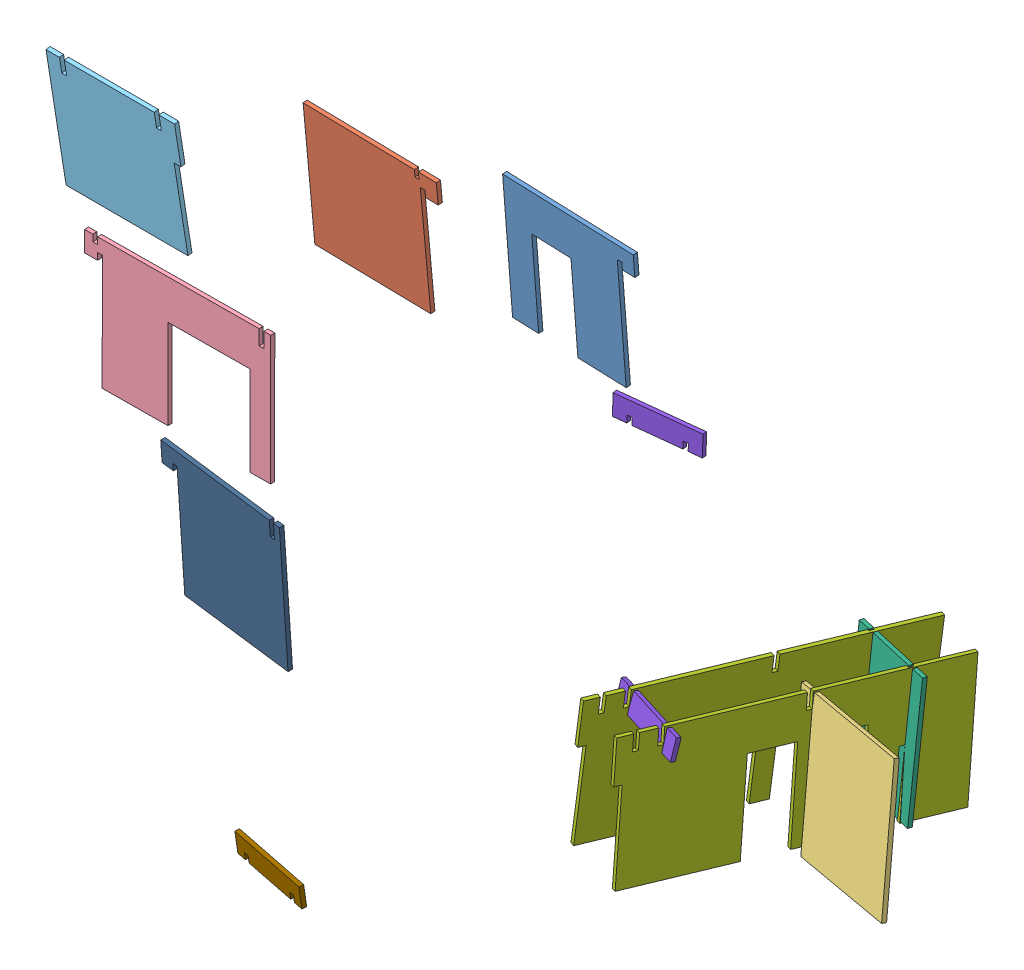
SolidWorks assembly Assemblage_cloisons.SLDASM, configuration Défaut (file format 3400). Lengths in mm.
Overall size (563.9 415.04 300.83).
13 component instances, 10 part files, 12 mates.
Components (placement in the parent):
- cloison_1B-3: cloison_1B.SLDPRT [Défaut] at (234.5568 743.5015 -63.7741) x (0.999323 0.001511 0.036748) z (-0.036538 -0.073441 0.99663) size (100 95 3)
- cloison_1A-3: cloison_1A.SLDPRT [Défaut] at (88.6893 717.2242 -63.8731) x (0.999841 -0.001803 0.017743) z (-0.017833 -0.091343 0.99566) size (100 95 3)
- cloison_1-4: cloison_1.SLDPRT [Défaut] at (509.8187 495.8389 -57.3081) x (-0.954899 -0.121536 -0.270918) z (0.287157 -0.145827 -0.946718) size (100 95 3)
- cloison_4-2: cloison_4.SLDPRT [Défaut] at (-53.2213 574.5421 -35.8793) x (0.99996 -0.001124 -0.008875) z (0.008875 0.000149 0.999961) size (136 95 3)
- cloison_3-2: cloison_3.SLDPRT [Défaut] at (-16.7399 741.4009 14.0782) x (0.999997 0.000546 0.002505) z (-0.00239 -0.155086 0.987898) size (95 95 3)
- cloison_5-1: cloison_5.SLDPRT [Défaut] at (385.8825 482.5792 -157.2815) x (0.979039 -0.02918 0.201571) z (-0.198759 0.079193 0.976844) size (60 95 3)
- cloison_2-1: cloison_2.SLDPRT [Défaut] at (385.1933 494.4661 22.6388) x (0.28161 -0.081395 -0.956071) z (0.959494 0.032433 0.279857) size (215 95 3)
- cloison_2-2: cloison_2.SLDPRT [Défaut] at (341.7651 495.7183 9.7404) x (0.28161 -0.081395 -0.956071) z (0.956103 -0.060317 0.286755) size (215 95 3)
- cloison_1A-4: cloison_1A.SLDPRT [Défaut] at (583.5876 410.5849 -185.2988) x (-0.999644 0.026687 0) z (0 0 -1) size (100 95 3) (suppressed, hidden)
- traverse_7-1: traverse_7.SLDPRT [Défaut] at (404.0784 570.8359 -7.33) x (-0.958465 0.02306 -0.284278) z (0.271722 -0.229076 -0.934714) size (60 15 3)
- traverse_8-1: traverse_8.SLDPRT [Défaut] at (237.2806 446.1024 97.2939) x (-0.980949 0.006075 -0.194171) z (0.193291 0.130553 -0.972417) size (60 15 3)
- traverse_7-2: traverse_7.SLDPRT [Défaut] at (361.0324 710.0788 -74.0869) x (-0.993853 0.001049 0.110704) z (-0.110686 -0.029813 -0.993408) size (60 15 3)
- cloison_1C-1: cloison_1C.SLDPRT [Défaut] at (57.9262 423.3582 -71.825) x (-0.99295 0.005121 -0.118425) z (0.118509 0.06433 -0.990867) size (100 95 3)
Mates (geometry in assembly coordinates):
- Coïncidente2: coincident: point of ?; point of ?
- Coïncidente18: coincident: point of ?; point of ?
- Coïncidente23: coincident: point of cloison_5-1; point of cloison_2-2
- Coïncidente24: coincident: point of cloison_5-1; point of cloison_2-1
- Perpendiculaire1: perpendicular: line of cloison_5-1; line of cloison_2-1
- Perpendiculaire2: perpendicular: line of cloison_5-1; line of cloison_2-2
- Coïncidente28: coincident: point of cloison_2-2; point of traverse_7-1
- Coïncidente29: coincident: point of cloison_2-1; point of traverse_7-1
- Coïncidente44: coincident: point of cloison_1-4; point of cloison_2-1
- Perpendiculaire18: perpendicular: line of cloison_2-2; line of traverse_7-1
- Perpendiculaire19: perpendicular: line of cloison_2-1; line of traverse_7-1
- Perpendiculaire20: perpendicular: line of cloison_1-4; line of cloison_2-1
